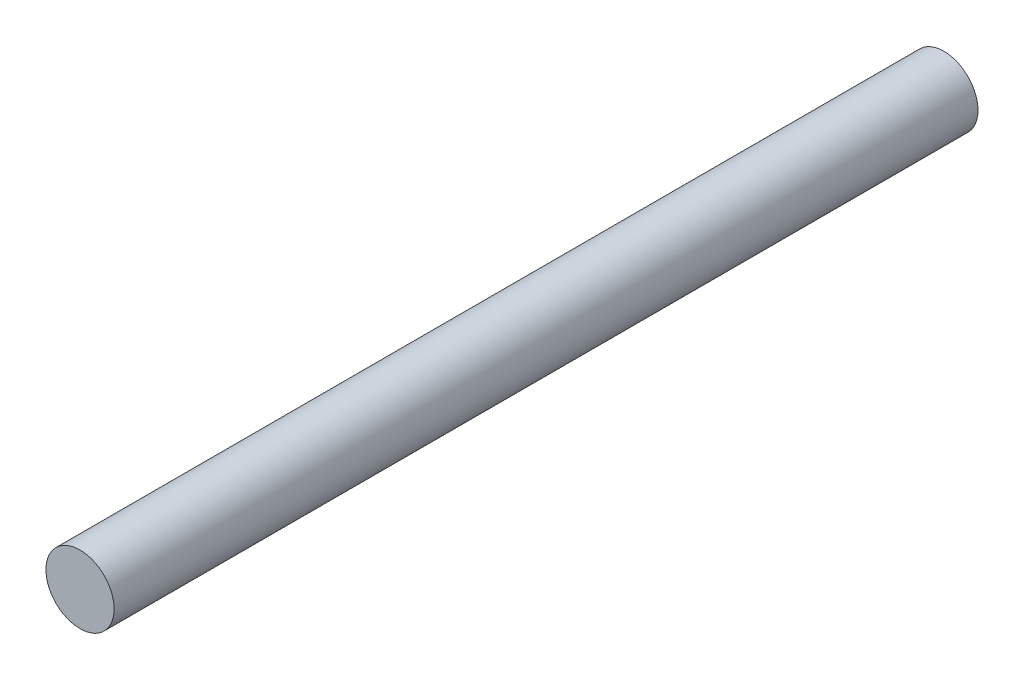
ISO-10303-21;
HEADER;
FILE_DESCRIPTION(('STEP AP214'),'2;1');
FILE_NAME('part.step','',(''),(''),'','','');
FILE_SCHEMA(('AUTOMOTIVE_DESIGN { 1 0 10303 214 1 1 1 1 }'));
ENDSEC;
DATA;
#1=APPLICATION_CONTEXT('core data for automotive mechanical design processes');
#2=APPLICATION_PROTOCOL_DEFINITION('international standard','automotive_design',2000,#1);
#3=PRODUCT_CONTEXT('',#1,'mechanical');
#4=PRODUCT('Part','Part','',(#3));
#5=PRODUCT_RELATED_PRODUCT_CATEGORY('part','',(#4));
#6=PRODUCT_DEFINITION_FORMATION('','',#4);
#7=PRODUCT_DEFINITION_CONTEXT('part definition',#1,'design');
#8=PRODUCT_DEFINITION('design','',#6,#7);
#9=PRODUCT_DEFINITION_SHAPE('','',#8);
#10=(LENGTH_UNIT() NAMED_UNIT(*) SI_UNIT(.MILLI.,.METRE.));
#11=(NAMED_UNIT(*) PLANE_ANGLE_UNIT() SI_UNIT($,.RADIAN.));
#12=(NAMED_UNIT(*) SI_UNIT($,.STERADIAN.) SOLID_ANGLE_UNIT());
#13=UNCERTAINTY_MEASURE_WITH_UNIT(LENGTH_MEASURE(1.E-05),#10,'distance_accuracy_value','');
#14=(GEOMETRIC_REPRESENTATION_CONTEXT(3) GLOBAL_UNCERTAINTY_ASSIGNED_CONTEXT((#13)) GLOBAL_UNIT_ASSIGNED_CONTEXT((#10,
#11,#12)) REPRESENTATION_CONTEXT('',''));
#15=CARTESIAN_POINT('',(0.,0.,0.));
#16=DIRECTION('',(0.,0.,1.));
#17=DIRECTION('',(1.,0.,0.));
#18=AXIS2_PLACEMENT_3D('',#15,#16,#17);
#19=CARTESIAN_POINT('',(0.,0.,0.));
#20=DIRECTION('',(0.,0.,1.));
#21=DIRECTION('',(1.,0.,0.));
#22=AXIS2_PLACEMENT_3D('',#19,#20,#21);
#23=PLANE('',#22);
#24=CARTESIAN_POINT('',(0.,0.,0.));
#25=DIRECTION('',(0.,0.,1.));
#26=DIRECTION('',(1.,0.,0.));
#27=AXIS2_PLACEMENT_3D('',#24,#25,#26);
#28=CIRCLE('',#27,2.5);
#29=CARTESIAN_POINT('',(2.5,0.,0.));
#30=VERTEX_POINT('',#29);
#31=EDGE_CURVE('E20',#30,#30,#28,.T.);
#32=ORIENTED_EDGE('',*,*,#31,.F.);
#33=EDGE_LOOP('',(#32));
#34=FACE_BOUND('',#33,.T.);
#35=ADVANCED_FACE('F13',(#34),#23,.F.);
#36=CARTESIAN_POINT('',(0.,0.,40.84));
#37=DIRECTION('',(0.,0.,-1.));
#38=DIRECTION('',(-1.,0.,0.));
#39=AXIS2_PLACEMENT_3D('',#36,#37,#38);
#40=CYLINDRICAL_SURFACE('',#39,2.5);
#41=CARTESIAN_POINT('',(0.,0.,63.34));
#42=DIRECTION('',(0.,0.,1.));
#43=DIRECTION('',(1.,0.,0.));
#44=AXIS2_PLACEMENT_3D('',#41,#42,#43);
#45=CIRCLE('',#44,2.5);
#46=CARTESIAN_POINT('',(2.5,0.,63.34));
#47=VERTEX_POINT('',#46);
#48=EDGE_CURVE('E8',#47,#47,#45,.T.);
#49=ORIENTED_EDGE('',*,*,#48,.F.);
#50=EDGE_LOOP('',(#49));
#51=FACE_BOUND('',#50,.T.);
#52=ORIENTED_EDGE('',*,*,#31,.T.);
#53=EDGE_LOOP('',(#52));
#54=FACE_BOUND('',#53,.T.);
#55=ADVANCED_FACE('F15',(#51,#54),#40,.T.);
#56=CARTESIAN_POINT('',(0.,0.,63.34));
#57=DIRECTION('',(0.,0.,1.));
#58=DIRECTION('',(1.,0.,0.));
#59=AXIS2_PLACEMENT_3D('',#56,#57,#58);
#60=PLANE('',#59);
#61=ORIENTED_EDGE('',*,*,#48,.T.);
#62=EDGE_LOOP('',(#61));
#63=FACE_BOUND('',#62,.T.);
#64=ADVANCED_FACE('F34',(#63),#60,.T.);
#65=CLOSED_SHELL('',(#35,#55,#64));
#66=MANIFOLD_SOLID_BREP('B1',#65);
#67=ADVANCED_BREP_SHAPE_REPRESENTATION('',(#18,#66),#14);
#68=SHAPE_DEFINITION_REPRESENTATION(#9,#67);
ENDSEC;
END-ISO-10303-21;
